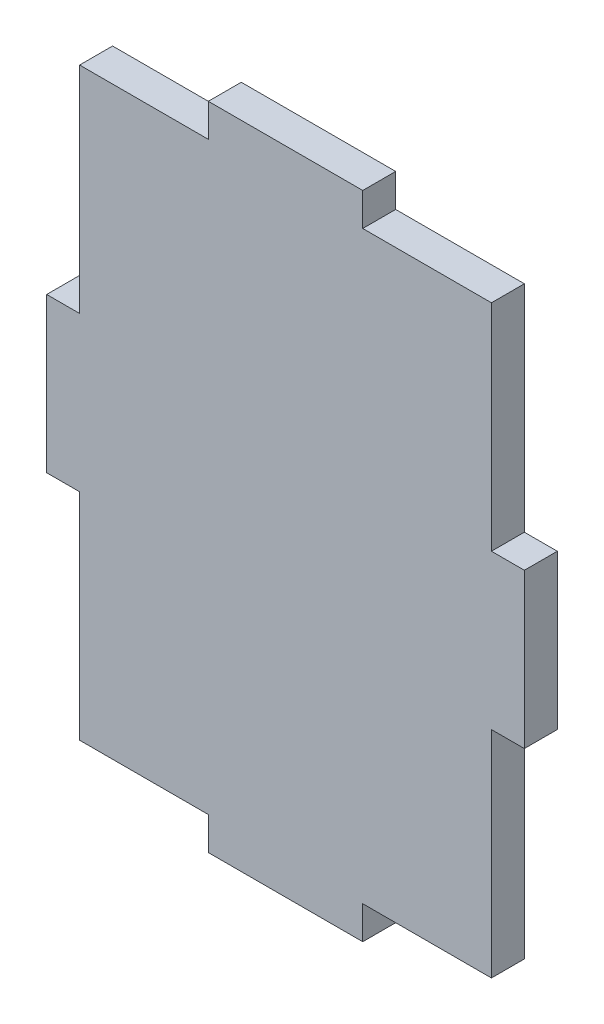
ISO-10303-21;
HEADER;
FILE_DESCRIPTION(('STEP AP214'),'2;1');
FILE_NAME('part.step','',(''),(''),'','','');
FILE_SCHEMA(('AUTOMOTIVE_DESIGN { 1 0 10303 214 1 1 1 1 }'));
ENDSEC;
DATA;
#1=APPLICATION_CONTEXT('core data for automotive mechanical design processes');
#2=APPLICATION_PROTOCOL_DEFINITION('international standard','automotive_design',2000,#1);
#3=PRODUCT_CONTEXT('',#1,'mechanical');
#4=PRODUCT('Part','Part','',(#3));
#5=PRODUCT_RELATED_PRODUCT_CATEGORY('part','',(#4));
#6=PRODUCT_DEFINITION_FORMATION('','',#4);
#7=PRODUCT_DEFINITION_CONTEXT('part definition',#1,'design');
#8=PRODUCT_DEFINITION('design','',#6,#7);
#9=PRODUCT_DEFINITION_SHAPE('','',#8);
#10=(LENGTH_UNIT() NAMED_UNIT(*) SI_UNIT(.MILLI.,.METRE.));
#11=(NAMED_UNIT(*) PLANE_ANGLE_UNIT() SI_UNIT($,.RADIAN.));
#12=(NAMED_UNIT(*) SI_UNIT($,.STERADIAN.) SOLID_ANGLE_UNIT());
#13=UNCERTAINTY_MEASURE_WITH_UNIT(LENGTH_MEASURE(1.E-05),#10,'distance_accuracy_value','');
#14=(GEOMETRIC_REPRESENTATION_CONTEXT(3) GLOBAL_UNCERTAINTY_ASSIGNED_CONTEXT((#13)) GLOBAL_UNIT_ASSIGNED_CONTEXT((#10,
#11,#12)) REPRESENTATION_CONTEXT('',''));
#15=CARTESIAN_POINT('',(0.,0.,0.));
#16=DIRECTION('',(0.,0.,1.));
#17=DIRECTION('',(1.,0.,0.));
#18=AXIS2_PLACEMENT_3D('',#15,#16,#17);
#19=CARTESIAN_POINT('',(137.5,0.,16.));
#20=DIRECTION('',(-1.,0.,0.));
#21=DIRECTION('',(0.,0.,1.));
#22=AXIS2_PLACEMENT_3D('',#19,#20,#21);
#23=PLANE('',#22);
#24=DIRECTION('',(0.,1.,0.));
#25=VECTOR('',#24,1.);
#26=CARTESIAN_POINT('',(137.5,0.,0.));
#27=LINE('',#26,#25);
#28=CARTESIAN_POINT('',(137.5,284.,0.));
#29=VERTEX_POINT('',#28);
#30=CARTESIAN_POINT('',(137.5,300.,0.));
#31=VERTEX_POINT('',#30);
#32=EDGE_CURVE('E318',#29,#31,#27,.T.);
#33=ORIENTED_EDGE('',*,*,#32,.T.);
#34=DIRECTION('',(0.,0.,-1.));
#35=VECTOR('',#34,1.);
#36=CARTESIAN_POINT('',(137.5,300.,16.));
#37=LINE('',#36,#35);
#38=CARTESIAN_POINT('',(137.5,300.,16.));
#39=VERTEX_POINT('',#38);
#40=EDGE_CURVE('E94',#39,#31,#37,.T.);
#41=ORIENTED_EDGE('',*,*,#40,.F.);
#42=DIRECTION('',(0.,1.,0.));
#43=VECTOR('',#42,1.);
#44=CARTESIAN_POINT('',(137.5,0.,16.));
#45=LINE('',#44,#43);
#46=CARTESIAN_POINT('',(137.5,284.,16.));
#47=VERTEX_POINT('',#46);
#48=EDGE_CURVE('E312',#47,#39,#45,.T.);
#49=ORIENTED_EDGE('',*,*,#48,.F.);
#50=DIRECTION('',(0.,0.,-1.));
#51=VECTOR('',#50,1.);
#52=CARTESIAN_POINT('',(137.5,284.,16.));
#53=LINE('',#52,#51);
#54=EDGE_CURVE('E12',#47,#29,#53,.T.);
#55=ORIENTED_EDGE('',*,*,#54,.T.);
#56=EDGE_LOOP('',(#33,#41,#49,#55));
#57=FACE_BOUND('',#56,.T.);
#58=ADVANCED_FACE('F84',(#57),#23,.F.);
#59=CARTESIAN_POINT('',(0.,300.,16.));
#60=DIRECTION('',(0.,1.,0.));
#61=DIRECTION('',(0.,0.,1.));
#62=AXIS2_PLACEMENT_3D('',#59,#60,#61);
#63=PLANE('',#62);
#64=DIRECTION('',(1.,0.,0.));
#65=VECTOR('',#64,1.);
#66=CARTESIAN_POINT('',(0.,300.,0.));
#67=LINE('',#66,#65);
#68=CARTESIAN_POINT('',(62.5,300.,0.));
#69=VERTEX_POINT('',#68);
#70=EDGE_CURVE('E313',#69,#31,#67,.T.);
#71=ORIENTED_EDGE('',*,*,#70,.F.);
#72=DIRECTION('',(0.,0.,-1.));
#73=VECTOR('',#72,1.);
#74=CARTESIAN_POINT('',(62.5,300.,16.));
#75=LINE('',#74,#73);
#76=CARTESIAN_POINT('',(62.5,300.,16.));
#77=VERTEX_POINT('',#76);
#78=EDGE_CURVE('E310',#77,#69,#75,.T.);
#79=ORIENTED_EDGE('',*,*,#78,.F.);
#80=DIRECTION('',(1.,0.,0.));
#81=VECTOR('',#80,1.);
#82=CARTESIAN_POINT('',(0.,300.,16.));
#83=LINE('',#82,#81);
#84=EDGE_CURVE('E316',#77,#39,#83,.T.);
#85=ORIENTED_EDGE('',*,*,#84,.T.);
#86=ORIENTED_EDGE('',*,*,#40,.T.);
#87=EDGE_LOOP('',(#71,#79,#85,#86));
#88=FACE_BOUND('',#87,.T.);
#89=ADVANCED_FACE('F449',(#88),#63,.T.);
#90=CARTESIAN_POINT('',(62.5,0.,16.));
#91=DIRECTION('',(-1.,0.,0.));
#92=DIRECTION('',(0.,0.,1.));
#93=AXIS2_PLACEMENT_3D('',#90,#91,#92);
#94=PLANE('',#93);
#95=DIRECTION('',(0.,1.,0.));
#96=VECTOR('',#95,1.);
#97=CARTESIAN_POINT('',(62.5,0.,0.));
#98=LINE('',#97,#96);
#99=CARTESIAN_POINT('',(62.5,284.,0.));
#100=VERTEX_POINT('',#99);
#101=EDGE_CURVE('E308',#100,#69,#98,.T.);
#102=ORIENTED_EDGE('',*,*,#101,.F.);
#103=DIRECTION('',(0.,0.,-1.));
#104=VECTOR('',#103,1.);
#105=CARTESIAN_POINT('',(62.5,284.,16.));
#106=LINE('',#105,#104);
#107=CARTESIAN_POINT('',(62.5,284.,16.));
#108=VERTEX_POINT('',#107);
#109=EDGE_CURVE('E103',#108,#100,#106,.T.);
#110=ORIENTED_EDGE('',*,*,#109,.F.);
#111=DIRECTION('',(0.,1.,0.));
#112=VECTOR('',#111,1.);
#113=CARTESIAN_POINT('',(62.5,0.,16.));
#114=LINE('',#113,#112);
#115=EDGE_CURVE('E323',#108,#77,#114,.T.);
#116=ORIENTED_EDGE('',*,*,#115,.T.);
#117=ORIENTED_EDGE('',*,*,#78,.T.);
#118=EDGE_LOOP('',(#102,#110,#116,#117));
#119=FACE_BOUND('',#118,.T.);
#120=ADVANCED_FACE('F309',(#119),#94,.T.);
#121=CARTESIAN_POINT('',(0.,0.,16.));
#122=DIRECTION('',(0.,0.,1.));
#123=DIRECTION('',(1.,0.,0.));
#124=AXIS2_PLACEMENT_3D('',#121,#122,#123);
#125=PLANE('',#124);
#126=ORIENTED_EDGE('',*,*,#115,.F.);
#127=DIRECTION('',(1.,0.,0.));
#128=VECTOR('',#127,1.);
#129=CARTESIAN_POINT('',(0.,284.,16.));
#130=LINE('',#129,#128);
#131=CARTESIAN_POINT('',(0.,284.,16.));
#132=VERTEX_POINT('',#131);
#133=EDGE_CURVE('E381',#132,#108,#130,.T.);
#134=ORIENTED_EDGE('',*,*,#133,.F.);
#135=DIRECTION('',(0.,1.,0.));
#136=VECTOR('',#135,1.);
#137=CARTESIAN_POINT('',(0.,0.,16.));
#138=LINE('',#137,#136);
#139=CARTESIAN_POINT('',(0.,179.5,16.));
#140=VERTEX_POINT('',#139);
#141=EDGE_CURVE('E302',#140,#132,#138,.T.);
#142=ORIENTED_EDGE('',*,*,#141,.F.);
#143=DIRECTION('',(-1.,0.,0.));
#144=VECTOR('',#143,1.);
#145=CARTESIAN_POINT('',(3.11382863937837E-13,179.5,16.));
#146=LINE('',#145,#144);
#147=CARTESIAN_POINT('',(-16.,179.5,16.));
#148=VERTEX_POINT('',#147);
#149=EDGE_CURVE('E352',#140,#148,#146,.T.);
#150=ORIENTED_EDGE('',*,*,#149,.T.);
#151=DIRECTION('',(0.,-1.,0.));
#152=VECTOR('',#151,1.);
#153=CARTESIAN_POINT('',(-16.0000000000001,0.,16.));
#154=LINE('',#153,#152);
#155=CARTESIAN_POINT('',(-16.,104.5,16.));
#156=VERTEX_POINT('',#155);
#157=EDGE_CURVE('E354',#148,#156,#154,.T.);
#158=ORIENTED_EDGE('',*,*,#157,.T.);
#159=DIRECTION('',(-1.,0.,0.));
#160=VECTOR('',#159,1.);
#161=CARTESIAN_POINT('',(0.,104.5,16.));
#162=LINE('',#161,#160);
#163=CARTESIAN_POINT('',(0.,104.5,16.));
#164=VERTEX_POINT('',#163);
#165=EDGE_CURVE('E357',#164,#156,#162,.T.);
#166=ORIENTED_EDGE('',*,*,#165,.F.);
#167=CARTESIAN_POINT('',(0.,0.,16.));
#168=VERTEX_POINT('',#167);
#169=EDGE_CURVE('E283',#168,#164,#138,.T.);
#170=ORIENTED_EDGE('',*,*,#169,.F.);
#171=DIRECTION('',(1.,0.,0.));
#172=VECTOR('',#171,1.);
#173=CARTESIAN_POINT('',(0.,0.,16.));
#174=LINE('',#173,#172);
#175=CARTESIAN_POINT('',(62.5,0.,16.));
#176=VERTEX_POINT('',#175);
#177=EDGE_CURVE('E374',#168,#176,#174,.T.);
#178=ORIENTED_EDGE('',*,*,#177,.T.);
#179=DIRECTION('',(0.,-1.,0.));
#180=VECTOR('',#179,1.);
#181=CARTESIAN_POINT('',(62.5,0.,16.));
#182=LINE('',#181,#180);
#183=CARTESIAN_POINT('',(62.5,-16.,16.));
#184=VERTEX_POINT('',#183);
#185=EDGE_CURVE('E239',#176,#184,#182,.T.);
#186=ORIENTED_EDGE('',*,*,#185,.T.);
#187=DIRECTION('',(1.,0.,0.));
#188=VECTOR('',#187,1.);
#189=CARTESIAN_POINT('',(62.5,-16.,16.));
#190=LINE('',#189,#188);
#191=CARTESIAN_POINT('',(137.5,-16.,16.));
#192=VERTEX_POINT('',#191);
#193=EDGE_CURVE('E242',#184,#192,#190,.T.);
#194=ORIENTED_EDGE('',*,*,#193,.T.);
#195=DIRECTION('',(0.,-1.,0.));
#196=VECTOR('',#195,1.);
#197=CARTESIAN_POINT('',(137.5,0.,16.));
#198=LINE('',#197,#196);
#199=CARTESIAN_POINT('',(137.5,0.,16.));
#200=VERTEX_POINT('',#199);
#201=EDGE_CURVE('E228',#200,#192,#198,.T.);
#202=ORIENTED_EDGE('',*,*,#201,.F.);
#203=CARTESIAN_POINT('',(200.,0.,16.));
#204=VERTEX_POINT('',#203);
#205=EDGE_CURVE('E293',#200,#204,#174,.T.);
#206=ORIENTED_EDGE('',*,*,#205,.T.);
#207=DIRECTION('',(0.,1.,0.));
#208=VECTOR('',#207,1.);
#209=CARTESIAN_POINT('',(200.,0.,16.));
#210=LINE('',#209,#208);
#211=CARTESIAN_POINT('',(200.,104.5,16.));
#212=VERTEX_POINT('',#211);
#213=EDGE_CURVE('E378',#204,#212,#210,.T.);
#214=ORIENTED_EDGE('',*,*,#213,.T.);
#215=DIRECTION('',(1.,0.,0.));
#216=VECTOR('',#215,1.);
#217=CARTESIAN_POINT('',(0.,104.5,16.));
#218=LINE('',#217,#216);
#219=CARTESIAN_POINT('',(216.,104.5,16.));
#220=VERTEX_POINT('',#219);
#221=EDGE_CURVE('E333',#212,#220,#218,.T.);
#222=ORIENTED_EDGE('',*,*,#221,.T.);
#223=DIRECTION('',(0.,-1.,0.));
#224=VECTOR('',#223,1.);
#225=CARTESIAN_POINT('',(216.,0.,16.));
#226=LINE('',#225,#224);
#227=CARTESIAN_POINT('',(216.,179.5,16.));
#228=VERTEX_POINT('',#227);
#229=EDGE_CURVE('E326',#228,#220,#226,.T.);
#230=ORIENTED_EDGE('',*,*,#229,.F.);
#231=DIRECTION('',(1.,0.,0.));
#232=VECTOR('',#231,1.);
#233=CARTESIAN_POINT('',(-3.11382863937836E-13,179.5,16.));
#234=LINE('',#233,#232);
#235=CARTESIAN_POINT('',(200.,179.5,16.));
#236=VERTEX_POINT('',#235);
#237=EDGE_CURVE('E329',#236,#228,#234,.T.);
#238=ORIENTED_EDGE('',*,*,#237,.F.);
#239=CARTESIAN_POINT('',(200.,284.,16.));
#240=VERTEX_POINT('',#239);
#241=EDGE_CURVE('E377',#236,#240,#210,.T.);
#242=ORIENTED_EDGE('',*,*,#241,.T.);
#243=EDGE_CURVE('E380',#47,#240,#130,.T.);
#244=ORIENTED_EDGE('',*,*,#243,.F.);
#245=ORIENTED_EDGE('',*,*,#48,.T.);
#246=ORIENTED_EDGE('',*,*,#84,.F.);
#247=EDGE_LOOP('',(#126,#134,#142,#150,#158,#166,#170,#178,#186,#194,#202,#206,#214,#222,#230,
#238,#242,#244,#245,#246));
#248=FACE_BOUND('',#247,.T.);
#249=ADVANCED_FACE('F394',(#248),#125,.T.);
#250=CARTESIAN_POINT('',(0.,0.,0.));
#251=DIRECTION('',(0.,0.,1.));
#252=DIRECTION('',(1.,0.,0.));
#253=AXIS2_PLACEMENT_3D('',#250,#251,#252);
#254=PLANE('',#253);
#255=ORIENTED_EDGE('',*,*,#32,.F.);
#256=DIRECTION('',(1.,0.,0.));
#257=VECTOR('',#256,1.);
#258=CARTESIAN_POINT('',(0.,284.,0.));
#259=LINE('',#258,#257);
#260=CARTESIAN_POINT('',(200.,284.,0.));
#261=VERTEX_POINT('',#260);
#262=EDGE_CURVE('E286',#29,#261,#259,.T.);
#263=ORIENTED_EDGE('',*,*,#262,.T.);
#264=DIRECTION('',(0.,1.,0.));
#265=VECTOR('',#264,1.);
#266=CARTESIAN_POINT('',(200.,0.,0.));
#267=LINE('',#266,#265);
#268=CARTESIAN_POINT('',(200.,179.5,0.));
#269=VERTEX_POINT('',#268);
#270=EDGE_CURVE('E277',#269,#261,#267,.T.);
#271=ORIENTED_EDGE('',*,*,#270,.F.);
#272=DIRECTION('',(1.,0.,0.));
#273=VECTOR('',#272,1.);
#274=CARTESIAN_POINT('',(-3.11382863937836E-13,179.5,0.));
#275=LINE('',#274,#273);
#276=CARTESIAN_POINT('',(216.,179.5,0.));
#277=VERTEX_POINT('',#276);
#278=EDGE_CURVE('E339',#269,#277,#275,.T.);
#279=ORIENTED_EDGE('',*,*,#278,.T.);
#280=DIRECTION('',(0.,-1.,0.));
#281=VECTOR('',#280,1.);
#282=CARTESIAN_POINT('',(216.,0.,0.));
#283=LINE('',#282,#281);
#284=CARTESIAN_POINT('',(216.,104.5,0.));
#285=VERTEX_POINT('',#284);
#286=EDGE_CURVE('E336',#277,#285,#283,.T.);
#287=ORIENTED_EDGE('',*,*,#286,.T.);
#288=DIRECTION('',(1.,0.,0.));
#289=VECTOR('',#288,1.);
#290=CARTESIAN_POINT('',(0.,104.5,0.));
#291=LINE('',#290,#289);
#292=CARTESIAN_POINT('',(200.,104.5,0.));
#293=VERTEX_POINT('',#292);
#294=EDGE_CURVE('E330',#293,#285,#291,.T.);
#295=ORIENTED_EDGE('',*,*,#294,.F.);
#296=CARTESIAN_POINT('',(200.,0.,0.));
#297=VERTEX_POINT('',#296);
#298=EDGE_CURVE('E280',#297,#293,#267,.T.);
#299=ORIENTED_EDGE('',*,*,#298,.F.);
#300=DIRECTION('',(1.,0.,0.));
#301=VECTOR('',#300,1.);
#302=CARTESIAN_POINT('',(0.,0.,0.));
#303=LINE('',#302,#301);
#304=CARTESIAN_POINT('',(137.5,0.,0.));
#305=VERTEX_POINT('',#304);
#306=EDGE_CURVE('E238',#305,#297,#303,.T.);
#307=ORIENTED_EDGE('',*,*,#306,.F.);
#308=DIRECTION('',(0.,-1.,0.));
#309=VECTOR('',#308,1.);
#310=CARTESIAN_POINT('',(137.5,0.,0.));
#311=LINE('',#310,#309);
#312=CARTESIAN_POINT('',(137.5,-16.,0.));
#313=VERTEX_POINT('',#312);
#314=EDGE_CURVE('E225',#305,#313,#311,.T.);
#315=ORIENTED_EDGE('',*,*,#314,.T.);
#316=DIRECTION('',(1.,0.,0.));
#317=VECTOR('',#316,1.);
#318=CARTESIAN_POINT('',(62.5,-16.,0.));
#319=LINE('',#318,#317);
#320=CARTESIAN_POINT('',(62.5,-16.,0.));
#321=VERTEX_POINT('',#320);
#322=EDGE_CURVE('E216',#321,#313,#319,.T.);
#323=ORIENTED_EDGE('',*,*,#322,.F.);
#324=DIRECTION('',(0.,-1.,0.));
#325=VECTOR('',#324,1.);
#326=CARTESIAN_POINT('',(62.5,0.,0.));
#327=LINE('',#326,#325);
#328=CARTESIAN_POINT('',(62.5,0.,0.));
#329=VERTEX_POINT('',#328);
#330=EDGE_CURVE('E233',#329,#321,#327,.T.);
#331=ORIENTED_EDGE('',*,*,#330,.F.);
#332=CARTESIAN_POINT('',(0.,0.,0.));
#333=VERTEX_POINT('',#332);
#334=EDGE_CURVE('E271',#333,#329,#303,.T.);
#335=ORIENTED_EDGE('',*,*,#334,.F.);
#336=DIRECTION('',(0.,1.,0.));
#337=VECTOR('',#336,1.);
#338=CARTESIAN_POINT('',(0.,0.,0.));
#339=LINE('',#338,#337);
#340=CARTESIAN_POINT('',(0.,104.5,0.));
#341=VERTEX_POINT('',#340);
#342=EDGE_CURVE('E291',#333,#341,#339,.T.);
#343=ORIENTED_EDGE('',*,*,#342,.T.);
#344=DIRECTION('',(-1.,0.,0.));
#345=VECTOR('',#344,1.);
#346=CARTESIAN_POINT('',(0.,104.5,0.));
#347=LINE('',#346,#345);
#348=CARTESIAN_POINT('',(-16.,104.5,0.));
#349=VERTEX_POINT('',#348);
#350=EDGE_CURVE('E355',#341,#349,#347,.T.);
#351=ORIENTED_EDGE('',*,*,#350,.T.);
#352=DIRECTION('',(0.,-1.,0.));
#353=VECTOR('',#352,1.);
#354=CARTESIAN_POINT('',(-16.0000000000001,0.,0.));
#355=LINE('',#354,#353);
#356=CARTESIAN_POINT('',(-16.,179.5,0.));
#357=VERTEX_POINT('',#356);
#358=EDGE_CURVE('E362',#357,#349,#355,.T.);
#359=ORIENTED_EDGE('',*,*,#358,.F.);
#360=DIRECTION('',(-1.,0.,0.));
#361=VECTOR('',#360,1.);
#362=CARTESIAN_POINT('',(3.11382863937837E-13,179.5,0.));
#363=LINE('',#362,#361);
#364=CARTESIAN_POINT('',(0.,179.5,0.));
#365=VERTEX_POINT('',#364);
#366=EDGE_CURVE('E248',#365,#357,#363,.T.);
#367=ORIENTED_EDGE('',*,*,#366,.F.);
#368=CARTESIAN_POINT('',(0.,284.,0.));
#369=VERTEX_POINT('',#368);
#370=EDGE_CURVE('E290',#365,#369,#339,.T.);
#371=ORIENTED_EDGE('',*,*,#370,.T.);
#372=EDGE_CURVE('E287',#369,#100,#259,.T.);
#373=ORIENTED_EDGE('',*,*,#372,.T.);
#374=ORIENTED_EDGE('',*,*,#101,.T.);
#375=ORIENTED_EDGE('',*,*,#70,.T.);
#376=EDGE_LOOP('',(#255,#263,#271,#279,#287,#295,#299,#307,#315,#323,#331,#335,#343,#351,#359,
#367,#371,#373,#374,#375));
#377=FACE_BOUND('',#376,.T.);
#378=ADVANCED_FACE('F236',(#377),#254,.F.);
#379=CARTESIAN_POINT('',(0.,104.5,16.));
#380=DIRECTION('',(0.,-1.,0.));
#381=DIRECTION('',(0.,0.,-1.));
#382=AXIS2_PLACEMENT_3D('',#379,#380,#381);
#383=PLANE('',#382);
#384=ORIENTED_EDGE('',*,*,#350,.F.);
#385=DIRECTION('',(0.,0.,-1.));
#386=VECTOR('',#385,1.);
#387=CARTESIAN_POINT('',(0.,104.5,16.));
#388=LINE('',#387,#386);
#389=EDGE_CURVE('E360',#164,#341,#388,.T.);
#390=ORIENTED_EDGE('',*,*,#389,.F.);
#391=ORIENTED_EDGE('',*,*,#165,.T.);
#392=DIRECTION('',(0.,0.,-1.));
#393=VECTOR('',#392,1.);
#394=CARTESIAN_POINT('',(-16.,104.5,16.));
#395=LINE('',#394,#393);
#396=EDGE_CURVE('E368',#156,#349,#395,.T.);
#397=ORIENTED_EDGE('',*,*,#396,.T.);
#398=EDGE_LOOP('',(#384,#390,#391,#397));
#399=FACE_BOUND('',#398,.T.);
#400=ADVANCED_FACE('F436',(#399),#383,.T.);
#401=CARTESIAN_POINT('',(-16.0000000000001,0.,16.));
#402=DIRECTION('',(1.,0.,0.));
#403=DIRECTION('',(0.,1.,0.));
#404=AXIS2_PLACEMENT_3D('',#401,#402,#403);
#405=PLANE('',#404);
#406=ORIENTED_EDGE('',*,*,#358,.T.);
#407=ORIENTED_EDGE('',*,*,#396,.F.);
#408=ORIENTED_EDGE('',*,*,#157,.F.);
#409=DIRECTION('',(0.,0.,-1.));
#410=VECTOR('',#409,1.);
#411=CARTESIAN_POINT('',(-16.,179.5,16.));
#412=LINE('',#411,#410);
#413=EDGE_CURVE('E370',#148,#357,#412,.T.);
#414=ORIENTED_EDGE('',*,*,#413,.T.);
#415=EDGE_LOOP('',(#406,#407,#408,#414));
#416=FACE_BOUND('',#415,.T.);
#417=ADVANCED_FACE('F433',(#416),#405,.F.);
#418=CARTESIAN_POINT('',(216.,0.,16.));
#419=DIRECTION('',(1.,0.,0.));
#420=DIRECTION('',(0.,1.,0.));
#421=AXIS2_PLACEMENT_3D('',#418,#419,#420);
#422=PLANE('',#421);
#423=ORIENTED_EDGE('',*,*,#286,.F.);
#424=DIRECTION('',(0.,0.,-1.));
#425=VECTOR('',#424,1.);
#426=CARTESIAN_POINT('',(216.,179.5,16.));
#427=LINE('',#426,#425);
#428=EDGE_CURVE('E350',#228,#277,#427,.T.);
#429=ORIENTED_EDGE('',*,*,#428,.F.);
#430=ORIENTED_EDGE('',*,*,#229,.T.);
#431=DIRECTION('',(0.,0.,-1.));
#432=VECTOR('',#431,1.);
#433=CARTESIAN_POINT('',(216.,104.5,16.));
#434=LINE('',#433,#432);
#435=EDGE_CURVE('E335',#220,#285,#434,.T.);
#436=ORIENTED_EDGE('',*,*,#435,.T.);
#437=EDGE_LOOP('',(#423,#429,#430,#436));
#438=FACE_BOUND('',#437,.T.);
#439=ADVANCED_FACE('F404',(#438),#422,.T.);
#440=CARTESIAN_POINT('',(0.,104.5,16.));
#441=DIRECTION('',(0.,1.,0.));
#442=DIRECTION('',(0.,0.,1.));
#443=AXIS2_PLACEMENT_3D('',#440,#441,#442);
#444=PLANE('',#443);
#445=ORIENTED_EDGE('',*,*,#294,.T.);
#446=ORIENTED_EDGE('',*,*,#435,.F.);
#447=ORIENTED_EDGE('',*,*,#221,.F.);
#448=DIRECTION('',(0.,0.,-1.));
#449=VECTOR('',#448,1.);
#450=CARTESIAN_POINT('',(200.,104.5,16.));
#451=LINE('',#450,#449);
#452=EDGE_CURVE('E346',#212,#293,#451,.T.);
#453=ORIENTED_EDGE('',*,*,#452,.T.);
#454=EDGE_LOOP('',(#445,#446,#447,#453));
#455=FACE_BOUND('',#454,.T.);
#456=ADVANCED_FACE('F408',(#455),#444,.F.);
#457=CARTESIAN_POINT('',(137.5,0.,16.));
#458=DIRECTION('',(1.,0.,0.));
#459=DIRECTION('',(0.,0.,-1.));
#460=AXIS2_PLACEMENT_3D('',#457,#458,#459);
#461=PLANE('',#460);
#462=ORIENTED_EDGE('',*,*,#314,.F.);
#463=DIRECTION('',(0.,0.,-1.));
#464=VECTOR('',#463,1.);
#465=CARTESIAN_POINT('',(137.5,0.,16.));
#466=LINE('',#465,#464);
#467=EDGE_CURVE('E249',#200,#305,#466,.T.);
#468=ORIENTED_EDGE('',*,*,#467,.F.);
#469=ORIENTED_EDGE('',*,*,#201,.T.);
#470=DIRECTION('',(0.,0.,-1.));
#471=VECTOR('',#470,1.);
#472=CARTESIAN_POINT('',(137.5,-16.,16.));
#473=LINE('',#472,#471);
#474=EDGE_CURVE('E223',#192,#313,#473,.T.);
#475=ORIENTED_EDGE('',*,*,#474,.T.);
#476=EDGE_LOOP('',(#462,#468,#469,#475));
#477=FACE_BOUND('',#476,.T.);
#478=ADVANCED_FACE('F224',(#477),#461,.T.);
#479=CARTESIAN_POINT('',(62.5,-16.,16.));
#480=DIRECTION('',(0.,1.,0.));
#481=DIRECTION('',(0.,0.,1.));
#482=AXIS2_PLACEMENT_3D('',#479,#480,#481);
#483=PLANE('',#482);
#484=ORIENTED_EDGE('',*,*,#322,.T.);
#485=ORIENTED_EDGE('',*,*,#474,.F.);
#486=ORIENTED_EDGE('',*,*,#193,.F.);
#487=DIRECTION('',(0.,0.,-1.));
#488=VECTOR('',#487,1.);
#489=CARTESIAN_POINT('',(62.5,-16.,16.));
#490=LINE('',#489,#488);
#491=EDGE_CURVE('E88',#184,#321,#490,.T.);
#492=ORIENTED_EDGE('',*,*,#491,.T.);
#493=EDGE_LOOP('',(#484,#485,#486,#492));
#494=FACE_BOUND('',#493,.T.);
#495=ADVANCED_FACE('F230',(#494),#483,.F.);
#496=CARTESIAN_POINT('',(62.5,0.,16.));
#497=DIRECTION('',(1.,0.,0.));
#498=DIRECTION('',(0.,0.,-1.));
#499=AXIS2_PLACEMENT_3D('',#496,#497,#498);
#500=PLANE('',#499);
#501=ORIENTED_EDGE('',*,*,#330,.T.);
#502=ORIENTED_EDGE('',*,*,#491,.F.);
#503=ORIENTED_EDGE('',*,*,#185,.F.);
#504=DIRECTION('',(0.,0.,-1.));
#505=VECTOR('',#504,1.);
#506=CARTESIAN_POINT('',(62.5,0.,16.));
#507=LINE('',#506,#505);
#508=EDGE_CURVE('E246',#176,#329,#507,.T.);
#509=ORIENTED_EDGE('',*,*,#508,.T.);
#510=EDGE_LOOP('',(#501,#502,#503,#509));
#511=FACE_BOUND('',#510,.T.);
#512=ADVANCED_FACE('F86',(#511),#500,.F.);
#513=CARTESIAN_POINT('',(-3.11382863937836E-13,179.5,16.));
#514=DIRECTION('',(0.,1.,0.));
#515=DIRECTION('',(-1.,0.,0.));
#516=AXIS2_PLACEMENT_3D('',#513,#514,#515);
#517=PLANE('',#516);
#518=ORIENTED_EDGE('',*,*,#278,.F.);
#519=DIRECTION('',(0.,0.,-1.));
#520=VECTOR('',#519,1.);
#521=CARTESIAN_POINT('',(200.,179.5,16.));
#522=LINE('',#521,#520);
#523=EDGE_CURVE('E348',#236,#269,#522,.T.);
#524=ORIENTED_EDGE('',*,*,#523,.F.);
#525=ORIENTED_EDGE('',*,*,#237,.T.);
#526=ORIENTED_EDGE('',*,*,#428,.T.);
#527=EDGE_LOOP('',(#518,#524,#525,#526));
#528=FACE_BOUND('',#527,.T.);
#529=ADVANCED_FACE('F401',(#528),#517,.T.);
#530=CARTESIAN_POINT('',(3.11382863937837E-13,179.5,16.));
#531=DIRECTION('',(0.,-1.,0.));
#532=DIRECTION('',(1.,0.,0.));
#533=AXIS2_PLACEMENT_3D('',#530,#531,#532);
#534=PLANE('',#533);
#535=ORIENTED_EDGE('',*,*,#366,.T.);
#536=ORIENTED_EDGE('',*,*,#413,.F.);
#537=ORIENTED_EDGE('',*,*,#149,.F.);
#538=DIRECTION('',(0.,0.,-1.));
#539=VECTOR('',#538,1.);
#540=CARTESIAN_POINT('',(0.,179.5,16.));
#541=LINE('',#540,#539);
#542=EDGE_CURVE('E340',#140,#365,#541,.T.);
#543=ORIENTED_EDGE('',*,*,#542,.T.);
#544=EDGE_LOOP('',(#535,#536,#537,#543));
#545=FACE_BOUND('',#544,.T.);
#546=ADVANCED_FACE('F420',(#545),#534,.F.);
#547=CARTESIAN_POINT('',(0.,0.,16.));
#548=DIRECTION('',(-1.,0.,0.));
#549=DIRECTION('',(0.,0.,1.));
#550=AXIS2_PLACEMENT_3D('',#547,#548,#549);
#551=PLANE('',#550);
#552=ORIENTED_EDGE('',*,*,#169,.T.);
#553=ORIENTED_EDGE('',*,*,#389,.T.);
#554=ORIENTED_EDGE('',*,*,#342,.F.);
#555=DIRECTION('',(0.,0.,-1.));
#556=VECTOR('',#555,1.);
#557=CARTESIAN_POINT('',(0.,0.,16.));
#558=LINE('',#557,#556);
#559=EDGE_CURVE('E276',#168,#333,#558,.T.);
#560=ORIENTED_EDGE('',*,*,#559,.F.);
#561=EDGE_LOOP('',(#552,#553,#554,#560));
#562=FACE_BOUND('',#561,.T.);
#563=ADVANCED_FACE('F413',(#562),#551,.T.);
#564=CARTESIAN_POINT('',(200.,0.,16.));
#565=DIRECTION('',(-1.,0.,0.));
#566=DIRECTION('',(0.,0.,1.));
#567=AXIS2_PLACEMENT_3D('',#564,#565,#566);
#568=PLANE('',#567);
#569=ORIENTED_EDGE('',*,*,#452,.F.);
#570=ORIENTED_EDGE('',*,*,#213,.F.);
#571=DIRECTION('',(0.,0.,-1.));
#572=VECTOR('',#571,1.);
#573=CARTESIAN_POINT('',(200.,0.,16.));
#574=LINE('',#573,#572);
#575=EDGE_CURVE('E250',#204,#297,#574,.T.);
#576=ORIENTED_EDGE('',*,*,#575,.T.);
#577=ORIENTED_EDGE('',*,*,#298,.T.);
#578=EDGE_LOOP('',(#569,#570,#576,#577));
#579=FACE_BOUND('',#578,.T.);
#580=ADVANCED_FACE('F410',(#579),#568,.F.);
#581=CARTESIAN_POINT('',(0.,0.,16.));
#582=DIRECTION('',(0.,1.,0.));
#583=DIRECTION('',(0.,0.,1.));
#584=AXIS2_PLACEMENT_3D('',#581,#582,#583);
#585=PLANE('',#584);
#586=ORIENTED_EDGE('',*,*,#205,.F.);
#587=ORIENTED_EDGE('',*,*,#467,.T.);
#588=ORIENTED_EDGE('',*,*,#306,.T.);
#589=ORIENTED_EDGE('',*,*,#575,.F.);
#590=EDGE_LOOP('',(#586,#587,#588,#589));
#591=FACE_BOUND('',#590,.T.);
#592=ADVANCED_FACE('F412',(#591),#585,.F.);
#593=ORIENTED_EDGE('',*,*,#508,.F.);
#594=ORIENTED_EDGE('',*,*,#177,.F.);
#595=ORIENTED_EDGE('',*,*,#559,.T.);
#596=ORIENTED_EDGE('',*,*,#334,.T.);
#597=EDGE_LOOP('',(#593,#594,#595,#596));
#598=FACE_BOUND('',#597,.T.);
#599=ADVANCED_FACE('F274',(#598),#585,.F.);
#600=ORIENTED_EDGE('',*,*,#241,.F.);
#601=ORIENTED_EDGE('',*,*,#523,.T.);
#602=ORIENTED_EDGE('',*,*,#270,.T.);
#603=DIRECTION('',(0.,0.,-1.));
#604=VECTOR('',#603,1.);
#605=CARTESIAN_POINT('',(200.,284.,16.));
#606=LINE('',#605,#604);
#607=EDGE_CURVE('E254',#240,#261,#606,.T.);
#608=ORIENTED_EDGE('',*,*,#607,.F.);
#609=EDGE_LOOP('',(#600,#601,#602,#608));
#610=FACE_BOUND('',#609,.T.);
#611=ADVANCED_FACE('F397',(#610),#568,.F.);
#612=ORIENTED_EDGE('',*,*,#542,.F.);
#613=ORIENTED_EDGE('',*,*,#141,.T.);
#614=DIRECTION('',(0.,0.,-1.));
#615=VECTOR('',#614,1.);
#616=CARTESIAN_POINT('',(0.,284.,16.));
#617=LINE('',#616,#615);
#618=EDGE_CURVE('E261',#132,#369,#617,.T.);
#619=ORIENTED_EDGE('',*,*,#618,.T.);
#620=ORIENTED_EDGE('',*,*,#370,.F.);
#621=EDGE_LOOP('',(#612,#613,#619,#620));
#622=FACE_BOUND('',#621,.T.);
#623=ADVANCED_FACE('F299',(#622),#551,.T.);
#624=CARTESIAN_POINT('',(0.,284.,16.));
#625=DIRECTION('',(0.,1.,0.));
#626=DIRECTION('',(0.,0.,1.));
#627=AXIS2_PLACEMENT_3D('',#624,#625,#626);
#628=PLANE('',#627);
#629=ORIENTED_EDGE('',*,*,#133,.T.);
#630=ORIENTED_EDGE('',*,*,#109,.T.);
#631=ORIENTED_EDGE('',*,*,#372,.F.);
#632=ORIENTED_EDGE('',*,*,#618,.F.);
#633=EDGE_LOOP('',(#629,#630,#631,#632));
#634=FACE_BOUND('',#633,.T.);
#635=ADVANCED_FACE('F305',(#634),#628,.T.);
#636=ORIENTED_EDGE('',*,*,#54,.F.);
#637=ORIENTED_EDGE('',*,*,#243,.T.);
#638=ORIENTED_EDGE('',*,*,#607,.T.);
#639=ORIENTED_EDGE('',*,*,#262,.F.);
#640=EDGE_LOOP('',(#636,#637,#638,#639));
#641=FACE_BOUND('',#640,.T.);
#642=ADVANCED_FACE('F387',(#641),#628,.T.);
#643=CLOSED_SHELL('',(#58,#89,#120,#249,#378,#400,#417,#439,#456,#478,#495,#512,#529,#546,#563,
#580,#592,#599,#611,#623,#635,#642));
#644=MANIFOLD_SOLID_BREP('B2',#643);
#645=ADVANCED_BREP_SHAPE_REPRESENTATION('',(#18,#644),#14);
#646=SHAPE_DEFINITION_REPRESENTATION(#9,#645);
ENDSEC;
END-ISO-10303-21;
